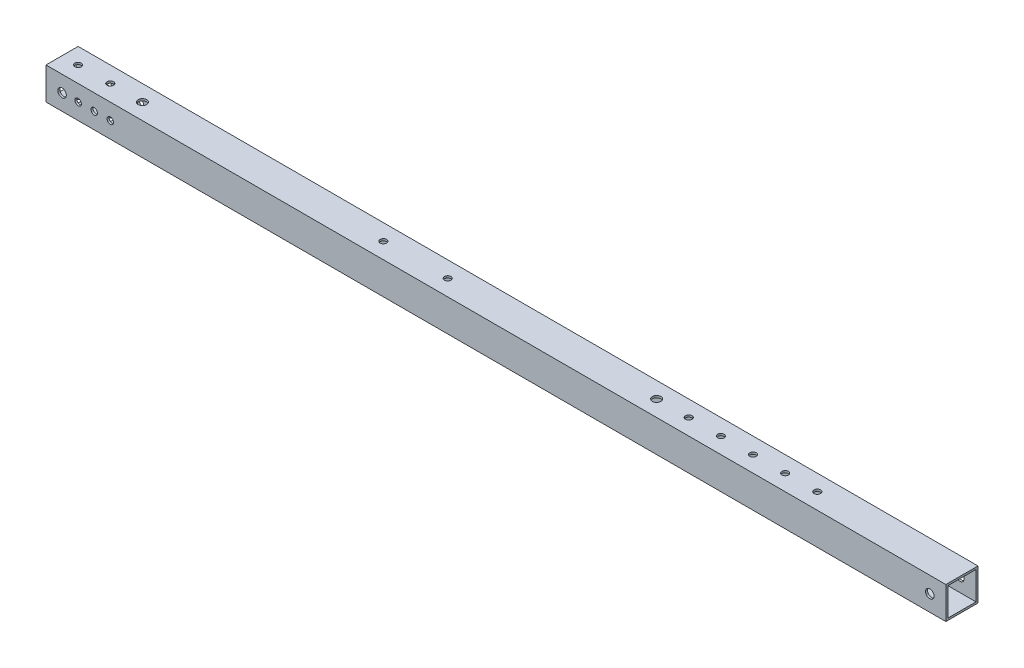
ISO-10303-21;
HEADER;
FILE_DESCRIPTION(('STEP AP214'),'2;1');
FILE_NAME('part.step','',(''),(''),'','','');
FILE_SCHEMA(('AUTOMOTIVE_DESIGN { 1 0 10303 214 1 1 1 1 }'));
ENDSEC;
DATA;
#1=APPLICATION_CONTEXT('core data for automotive mechanical design processes');
#2=APPLICATION_PROTOCOL_DEFINITION('international standard','automotive_design',2000,#1);
#3=PRODUCT_CONTEXT('',#1,'mechanical');
#4=PRODUCT('Part','Part','',(#3));
#5=PRODUCT_RELATED_PRODUCT_CATEGORY('part','',(#4));
#6=PRODUCT_DEFINITION_FORMATION('','',#4);
#7=PRODUCT_DEFINITION_CONTEXT('part definition',#1,'design');
#8=PRODUCT_DEFINITION('design','',#6,#7);
#9=PRODUCT_DEFINITION_SHAPE('','',#8);
#10=(LENGTH_UNIT() NAMED_UNIT(*) SI_UNIT(.MILLI.,.METRE.));
#11=(NAMED_UNIT(*) PLANE_ANGLE_UNIT() SI_UNIT($,.RADIAN.));
#12=(NAMED_UNIT(*) SI_UNIT($,.STERADIAN.) SOLID_ANGLE_UNIT());
#13=UNCERTAINTY_MEASURE_WITH_UNIT(LENGTH_MEASURE(1.E-05),#10,'distance_accuracy_value','');
#14=(GEOMETRIC_REPRESENTATION_CONTEXT(3) GLOBAL_UNCERTAINTY_ASSIGNED_CONTEXT((#13)) GLOBAL_UNIT_ASSIGNED_CONTEXT((#10,
#11,#12)) REPRESENTATION_CONTEXT('',''));
#15=CARTESIAN_POINT('',(0.,0.,0.));
#16=DIRECTION('',(0.,0.,1.));
#17=DIRECTION('',(1.,0.,0.));
#18=AXIS2_PLACEMENT_3D('',#15,#16,#17);
#19=CARTESIAN_POINT('',(711.2,-12.7,12.7));
#20=DIRECTION('',(0.,0.,-1.));
#21=DIRECTION('',(-1.,0.,0.));
#22=AXIS2_PLACEMENT_3D('',#19,#20,#21);
#23=PLANE('',#22);
#24=DIRECTION('',(0.,-1.,0.));
#25=VECTOR('',#24,1.);
#26=CARTESIAN_POINT('',(0.,-12.7,12.7));
#27=LINE('',#26,#25);
#28=CARTESIAN_POINT('',(0.,12.7,12.7));
#29=VERTEX_POINT('',#28);
#30=CARTESIAN_POINT('',(0.,-12.7,12.7));
#31=VERTEX_POINT('',#30);
#32=EDGE_CURVE('E178',#29,#31,#27,.T.);
#33=ORIENTED_EDGE('',*,*,#32,.T.);
#34=DIRECTION('',(-1.,0.,0.));
#35=VECTOR('',#34,1.);
#36=CARTESIAN_POINT('',(711.2,-12.7,12.7));
#37=LINE('',#36,#35);
#38=CARTESIAN_POINT('',(711.2,-12.7,12.7));
#39=VERTEX_POINT('',#38);
#40=EDGE_CURVE('E186',#39,#31,#37,.T.);
#41=ORIENTED_EDGE('',*,*,#40,.F.);
#42=DIRECTION('',(0.,-1.,0.));
#43=VECTOR('',#42,1.);
#44=CARTESIAN_POINT('',(711.2,-12.7,12.7));
#45=LINE('',#44,#43);
#46=CARTESIAN_POINT('',(711.2,12.7,12.7));
#47=VERTEX_POINT('',#46);
#48=EDGE_CURVE('E165',#47,#39,#45,.T.);
#49=ORIENTED_EDGE('',*,*,#48,.F.);
#50=DIRECTION('',(-1.,0.,0.));
#51=VECTOR('',#50,1.);
#52=CARTESIAN_POINT('',(711.2,12.7,12.7));
#53=LINE('',#52,#51);
#54=EDGE_CURVE('E47',#47,#29,#53,.T.);
#55=ORIENTED_EDGE('',*,*,#54,.T.);
#56=EDGE_LOOP('',(#33,#41,#49,#55));
#57=FACE_BOUND('',#56,.T.);
#58=CARTESIAN_POINT('',(50.8,0.,12.7));
#59=DIRECTION('',(0.,0.,1.));
#60=DIRECTION('',(1.,0.,0.));
#61=AXIS2_PLACEMENT_3D('',#58,#59,#60);
#62=CIRCLE('',#61,2.55269999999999);
#63=CARTESIAN_POINT('',(53.3527,0.,12.7));
#64=VERTEX_POINT('',#63);
#65=EDGE_CURVE('E429',#64,#64,#62,.T.);
#66=ORIENTED_EDGE('',*,*,#65,.F.);
#67=EDGE_LOOP('',(#66));
#68=FACE_BOUND('',#67,.T.);
#69=CARTESIAN_POINT('',(38.1,0.,12.7));
#70=DIRECTION('',(0.,0.,1.));
#71=DIRECTION('',(1.,0.,0.));
#72=AXIS2_PLACEMENT_3D('',#69,#70,#71);
#73=CIRCLE('',#72,2.55269999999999);
#74=CARTESIAN_POINT('',(40.6527,0.,12.7));
#75=VERTEX_POINT('',#74);
#76=EDGE_CURVE('E419',#75,#75,#73,.T.);
#77=ORIENTED_EDGE('',*,*,#76,.F.);
#78=EDGE_LOOP('',(#77));
#79=FACE_BOUND('',#78,.T.);
#80=CARTESIAN_POINT('',(25.4,0.,12.7));
#81=DIRECTION('',(0.,0.,1.));
#82=DIRECTION('',(1.,0.,0.));
#83=AXIS2_PLACEMENT_3D('',#80,#81,#82);
#84=CIRCLE('',#83,2.55269999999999);
#85=CARTESIAN_POINT('',(27.9527,0.,12.7));
#86=VERTEX_POINT('',#85);
#87=EDGE_CURVE('E409',#86,#86,#84,.T.);
#88=ORIENTED_EDGE('',*,*,#87,.F.);
#89=EDGE_LOOP('',(#88));
#90=FACE_BOUND('',#89,.T.);
#91=CARTESIAN_POINT('',(698.5,0.,12.7));
#92=DIRECTION('',(0.,0.,1.));
#93=DIRECTION('',(1.,0.,0.));
#94=AXIS2_PLACEMENT_3D('',#91,#92,#93);
#95=CIRCLE('',#94,3.373501);
#96=CARTESIAN_POINT('',(701.873501,0.,12.7));
#97=VERTEX_POINT('',#96);
#98=EDGE_CURVE('E283',#97,#97,#95,.T.);
#99=ORIENTED_EDGE('',*,*,#98,.F.);
#100=EDGE_LOOP('',(#99));
#101=FACE_BOUND('',#100,.T.);
#102=CARTESIAN_POINT('',(12.7,0.,12.7));
#103=DIRECTION('',(0.,0.,1.));
#104=DIRECTION('',(1.,0.,0.));
#105=AXIS2_PLACEMENT_3D('',#102,#103,#104);
#106=CIRCLE('',#105,3.37350099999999);
#107=CARTESIAN_POINT('',(16.073501,0.,12.7));
#108=VERTEX_POINT('',#107);
#109=EDGE_CURVE('E613',#108,#108,#106,.T.);
#110=ORIENTED_EDGE('',*,*,#109,.F.);
#111=EDGE_LOOP('',(#110));
#112=FACE_BOUND('',#111,.T.);
#113=ADVANCED_FACE('F37',(#57,#68,#79,#90,#101,#112),#23,.F.);
#114=CARTESIAN_POINT('',(711.2,0.,0.));
#115=DIRECTION('',(-1.,0.,0.));
#116=DIRECTION('',(0.,0.,1.));
#117=AXIS2_PLACEMENT_3D('',#114,#115,#116);
#118=PLANE('',#117);
#119=DIRECTION('',(0.,1.,0.));
#120=VECTOR('',#119,1.);
#121=CARTESIAN_POINT('',(711.2,-12.7,-12.7));
#122=LINE('',#121,#120);
#123=CARTESIAN_POINT('',(711.2,-12.7,-12.7));
#124=VERTEX_POINT('',#123);
#125=CARTESIAN_POINT('',(711.2,12.7,-12.7));
#126=VERTEX_POINT('',#125);
#127=EDGE_CURVE('E157',#124,#126,#122,.T.);
#128=ORIENTED_EDGE('',*,*,#127,.T.);
#129=DIRECTION('',(0.,0.,1.));
#130=VECTOR('',#129,1.);
#131=CARTESIAN_POINT('',(711.2,12.7,12.7));
#132=LINE('',#131,#130);
#133=EDGE_CURVE('E161',#126,#47,#132,.T.);
#134=ORIENTED_EDGE('',*,*,#133,.T.);
#135=ORIENTED_EDGE('',*,*,#48,.T.);
#136=DIRECTION('',(0.,0.,-1.));
#137=VECTOR('',#136,1.);
#138=CARTESIAN_POINT('',(711.2,-12.7,12.7));
#139=LINE('',#138,#137);
#140=EDGE_CURVE('E168',#39,#124,#139,.T.);
#141=ORIENTED_EDGE('',*,*,#140,.T.);
#142=EDGE_LOOP('',(#128,#134,#135,#141));
#143=FACE_BOUND('',#142,.T.);
#144=DIRECTION('',(0.,1.,0.));
#145=VECTOR('',#144,1.);
#146=CARTESIAN_POINT('',(711.2,-11.1125,-11.1125));
#147=LINE('',#146,#145);
#148=CARTESIAN_POINT('',(711.2,-11.1125,-11.1125));
#149=VERTEX_POINT('',#148);
#150=CARTESIAN_POINT('',(711.2,11.1125,-11.1125));
#151=VERTEX_POINT('',#150);
#152=EDGE_CURVE('E105',#149,#151,#147,.T.);
#153=ORIENTED_EDGE('',*,*,#152,.F.);
#154=DIRECTION('',(0.,0.,-1.));
#155=VECTOR('',#154,1.);
#156=CARTESIAN_POINT('',(711.2,-11.1125,11.1125));
#157=LINE('',#156,#155);
#158=CARTESIAN_POINT('',(711.2,-11.1125,11.1125));
#159=VERTEX_POINT('',#158);
#160=EDGE_CURVE('E133',#159,#149,#157,.T.);
#161=ORIENTED_EDGE('',*,*,#160,.F.);
#162=DIRECTION('',(0.,-1.,0.));
#163=VECTOR('',#162,1.);
#164=CARTESIAN_POINT('',(711.2,-11.1125,11.1125));
#165=LINE('',#164,#163);
#166=CARTESIAN_POINT('',(711.2,11.1125,11.1125));
#167=VERTEX_POINT('',#166);
#168=EDGE_CURVE('E128',#167,#159,#165,.T.);
#169=ORIENTED_EDGE('',*,*,#168,.F.);
#170=DIRECTION('',(0.,0.,1.));
#171=VECTOR('',#170,1.);
#172=CARTESIAN_POINT('',(711.2,11.1125,11.1125));
#173=LINE('',#172,#171);
#174=EDGE_CURVE('E114',#151,#167,#173,.T.);
#175=ORIENTED_EDGE('',*,*,#174,.F.);
#176=EDGE_LOOP('',(#153,#161,#169,#175));
#177=FACE_BOUND('',#176,.T.);
#178=ADVANCED_FACE('F127',(#143,#177),#118,.F.);
#179=CARTESIAN_POINT('',(0.,0.,0.));
#180=DIRECTION('',(-1.,0.,0.));
#181=DIRECTION('',(0.,0.,1.));
#182=AXIS2_PLACEMENT_3D('',#179,#180,#181);
#183=PLANE('',#182);
#184=DIRECTION('',(0.,1.,0.));
#185=VECTOR('',#184,1.);
#186=CARTESIAN_POINT('',(0.,-12.7,-12.7));
#187=LINE('',#186,#185);
#188=CARTESIAN_POINT('',(0.,-12.7,-12.7));
#189=VERTEX_POINT('',#188);
#190=CARTESIAN_POINT('',(0.,12.7,-12.7));
#191=VERTEX_POINT('',#190);
#192=EDGE_CURVE('E123',#189,#191,#187,.T.);
#193=ORIENTED_EDGE('',*,*,#192,.F.);
#194=DIRECTION('',(0.,0.,-1.));
#195=VECTOR('',#194,1.);
#196=CARTESIAN_POINT('',(0.,-12.7,12.7));
#197=LINE('',#196,#195);
#198=EDGE_CURVE('E162',#31,#189,#197,.T.);
#199=ORIENTED_EDGE('',*,*,#198,.F.);
#200=ORIENTED_EDGE('',*,*,#32,.F.);
#201=DIRECTION('',(0.,0.,1.));
#202=VECTOR('',#201,1.);
#203=CARTESIAN_POINT('',(0.,12.7,12.7));
#204=LINE('',#203,#202);
#205=EDGE_CURVE('E175',#191,#29,#204,.T.);
#206=ORIENTED_EDGE('',*,*,#205,.F.);
#207=EDGE_LOOP('',(#193,#199,#200,#206));
#208=FACE_BOUND('',#207,.T.);
#209=DIRECTION('',(0.,0.,-1.));
#210=VECTOR('',#209,1.);
#211=CARTESIAN_POINT('',(0.,-11.1125,11.1125));
#212=LINE('',#211,#210);
#213=CARTESIAN_POINT('',(0.,-11.1125,11.1125));
#214=VERTEX_POINT('',#213);
#215=CARTESIAN_POINT('',(0.,-11.1125,-11.1125));
#216=VERTEX_POINT('',#215);
#217=EDGE_CURVE('E115',#214,#216,#212,.T.);
#218=ORIENTED_EDGE('',*,*,#217,.T.);
#219=DIRECTION('',(0.,1.,0.));
#220=VECTOR('',#219,1.);
#221=CARTESIAN_POINT('',(0.,-11.1125,-11.1125));
#222=LINE('',#221,#220);
#223=CARTESIAN_POINT('',(0.,11.1125,-11.1125));
#224=VERTEX_POINT('',#223);
#225=EDGE_CURVE('E63',#216,#224,#222,.T.);
#226=ORIENTED_EDGE('',*,*,#225,.T.);
#227=DIRECTION('',(0.,0.,1.));
#228=VECTOR('',#227,1.);
#229=CARTESIAN_POINT('',(0.,11.1125,11.1125));
#230=LINE('',#229,#228);
#231=CARTESIAN_POINT('',(0.,11.1125,11.1125));
#232=VERTEX_POINT('',#231);
#233=EDGE_CURVE('E121',#224,#232,#230,.T.);
#234=ORIENTED_EDGE('',*,*,#233,.T.);
#235=DIRECTION('',(0.,-1.,0.));
#236=VECTOR('',#235,1.);
#237=CARTESIAN_POINT('',(0.,-11.1125,11.1125));
#238=LINE('',#237,#236);
#239=EDGE_CURVE('E144',#232,#214,#238,.T.);
#240=ORIENTED_EDGE('',*,*,#239,.T.);
#241=EDGE_LOOP('',(#218,#226,#234,#240));
#242=FACE_BOUND('',#241,.T.);
#243=ADVANCED_FACE('F466',(#208,#242),#183,.T.);
#244=CARTESIAN_POINT('',(711.2,-12.7,-12.7));
#245=DIRECTION('',(0.,0.,1.));
#246=DIRECTION('',(1.,0.,0.));
#247=AXIS2_PLACEMENT_3D('',#244,#245,#246);
#248=PLANE('',#247);
#249=CARTESIAN_POINT('',(12.7,0.,-12.7));
#250=DIRECTION('',(0.,0.,1.));
#251=DIRECTION('',(1.,0.,0.));
#252=AXIS2_PLACEMENT_3D('',#249,#250,#251);
#253=CIRCLE('',#252,3.373501);
#254=CARTESIAN_POINT('',(16.073501,0.,-12.7));
#255=VERTEX_POINT('',#254);
#256=EDGE_CURVE('E611',#255,#255,#253,.T.);
#257=ORIENTED_EDGE('',*,*,#256,.T.);
#258=EDGE_LOOP('',(#257));
#259=FACE_BOUND('',#258,.T.);
#260=CARTESIAN_POINT('',(698.5,0.,-12.7));
#261=DIRECTION('',(0.,0.,1.));
#262=DIRECTION('',(1.,0.,0.));
#263=AXIS2_PLACEMENT_3D('',#260,#261,#262);
#264=CIRCLE('',#263,3.373501);
#265=CARTESIAN_POINT('',(701.873501,0.,-12.7));
#266=VERTEX_POINT('',#265);
#267=EDGE_CURVE('E273',#266,#266,#264,.T.);
#268=ORIENTED_EDGE('',*,*,#267,.T.);
#269=EDGE_LOOP('',(#268));
#270=FACE_BOUND('',#269,.T.);
#271=CARTESIAN_POINT('',(25.4,0.,-12.7));
#272=DIRECTION('',(0.,0.,1.));
#273=DIRECTION('',(1.,0.,0.));
#274=AXIS2_PLACEMENT_3D('',#271,#272,#273);
#275=CIRCLE('',#274,2.55269999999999);
#276=CARTESIAN_POINT('',(27.9527,0.,-12.7));
#277=VERTEX_POINT('',#276);
#278=EDGE_CURVE('E209',#277,#277,#275,.T.);
#279=ORIENTED_EDGE('',*,*,#278,.T.);
#280=EDGE_LOOP('',(#279));
#281=FACE_BOUND('',#280,.T.);
#282=CARTESIAN_POINT('',(38.1,0.,-12.7));
#283=DIRECTION('',(0.,0.,1.));
#284=DIRECTION('',(1.,0.,0.));
#285=AXIS2_PLACEMENT_3D('',#282,#283,#284);
#286=CIRCLE('',#285,2.55269999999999);
#287=CARTESIAN_POINT('',(40.6527,0.,-12.7));
#288=VERTEX_POINT('',#287);
#289=EDGE_CURVE('E203',#288,#288,#286,.T.);
#290=ORIENTED_EDGE('',*,*,#289,.T.);
#291=EDGE_LOOP('',(#290));
#292=FACE_BOUND('',#291,.T.);
#293=CARTESIAN_POINT('',(50.8,0.,-12.7));
#294=DIRECTION('',(0.,0.,1.));
#295=DIRECTION('',(1.,0.,0.));
#296=AXIS2_PLACEMENT_3D('',#293,#294,#295);
#297=CIRCLE('',#296,2.55269999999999);
#298=CARTESIAN_POINT('',(53.3527,0.,-12.7));
#299=VERTEX_POINT('',#298);
#300=EDGE_CURVE('E197',#299,#299,#297,.T.);
#301=ORIENTED_EDGE('',*,*,#300,.T.);
#302=EDGE_LOOP('',(#301));
#303=FACE_BOUND('',#302,.T.);
#304=ORIENTED_EDGE('',*,*,#192,.T.);
#305=DIRECTION('',(-1.,0.,0.));
#306=VECTOR('',#305,1.);
#307=CARTESIAN_POINT('',(711.2,12.7,-12.7));
#308=LINE('',#307,#306);
#309=EDGE_CURVE('E11',#126,#191,#308,.T.);
#310=ORIENTED_EDGE('',*,*,#309,.F.);
#311=ORIENTED_EDGE('',*,*,#127,.F.);
#312=DIRECTION('',(-1.,0.,0.));
#313=VECTOR('',#312,1.);
#314=CARTESIAN_POINT('',(711.2,-12.7,-12.7));
#315=LINE('',#314,#313);
#316=EDGE_CURVE('E171',#124,#189,#315,.T.);
#317=ORIENTED_EDGE('',*,*,#316,.T.);
#318=EDGE_LOOP('',(#304,#310,#311,#317));
#319=FACE_BOUND('',#318,.T.);
#320=ADVANCED_FACE('F39',(#259,#270,#281,#292,#303,#319),#248,.F.);
#321=CARTESIAN_POINT('',(711.2,12.7,12.7));
#322=DIRECTION('',(0.,-1.,0.));
#323=DIRECTION('',(0.,0.,-1.));
#324=AXIS2_PLACEMENT_3D('',#321,#322,#323);
#325=PLANE('',#324);
#326=CARTESIAN_POINT('',(469.9,12.7,0.));
#327=DIRECTION('',(0.,1.,0.));
#328=DIRECTION('',(0.,0.,1.));
#329=AXIS2_PLACEMENT_3D('',#326,#327,#328);
#330=CIRCLE('',#329,3.373501);
#331=CARTESIAN_POINT('',(469.9,12.7,3.373501));
#332=VERTEX_POINT('',#331);
#333=EDGE_CURVE('E279',#332,#332,#330,.T.);
#334=ORIENTED_EDGE('',*,*,#333,.F.);
#335=EDGE_LOOP('',(#334));
#336=FACE_BOUND('',#335,.T.);
#337=CARTESIAN_POINT('',(63.5,12.7,0.));
#338=DIRECTION('',(0.,1.,0.));
#339=DIRECTION('',(0.,0.,1.));
#340=AXIS2_PLACEMENT_3D('',#337,#338,#339);
#341=CIRCLE('',#340,3.373501);
#342=CARTESIAN_POINT('',(63.5,12.7,3.373501));
#343=VERTEX_POINT('',#342);
#344=EDGE_CURVE('E303',#343,#343,#341,.T.);
#345=ORIENTED_EDGE('',*,*,#344,.F.);
#346=EDGE_LOOP('',(#345));
#347=FACE_BOUND('',#346,.T.);
#348=CARTESIAN_POINT('',(12.7,12.7,0.));
#349=DIRECTION('',(0.,1.,0.));
#350=DIRECTION('',(0.,0.,1.));
#351=AXIS2_PLACEMENT_3D('',#348,#349,#350);
#352=CIRCLE('',#351,2.55269999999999);
#353=CARTESIAN_POINT('',(12.7,12.7,2.55269999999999));
#354=VERTEX_POINT('',#353);
#355=EDGE_CURVE('E313',#354,#354,#352,.T.);
#356=ORIENTED_EDGE('',*,*,#355,.F.);
#357=EDGE_LOOP('',(#356));
#358=FACE_BOUND('',#357,.T.);
#359=CARTESIAN_POINT('',(38.1,12.7,0.));
#360=DIRECTION('',(0.,1.,0.));
#361=DIRECTION('',(0.,0.,1.));
#362=AXIS2_PLACEMENT_3D('',#359,#360,#361);
#363=CIRCLE('',#362,2.55269999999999);
#364=CARTESIAN_POINT('',(38.1,12.7,2.55269999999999));
#365=VERTEX_POINT('',#364);
#366=EDGE_CURVE('E323',#365,#365,#363,.T.);
#367=ORIENTED_EDGE('',*,*,#366,.F.);
#368=EDGE_LOOP('',(#367));
#369=FACE_BOUND('',#368,.T.);
#370=CARTESIAN_POINT('',(596.9,12.7,0.));
#371=DIRECTION('',(0.,1.,0.));
#372=DIRECTION('',(0.,0.,1.));
#373=AXIS2_PLACEMENT_3D('',#370,#371,#372);
#374=CIRCLE('',#373,2.55269999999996);
#375=CARTESIAN_POINT('',(596.9,12.7,2.55269999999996));
#376=VERTEX_POINT('',#375);
#377=EDGE_CURVE('E333',#376,#376,#374,.T.);
#378=ORIENTED_EDGE('',*,*,#377,.F.);
#379=EDGE_LOOP('',(#378));
#380=FACE_BOUND('',#379,.T.);
#381=CARTESIAN_POINT('',(254.,12.7,0.));
#382=DIRECTION('',(0.,1.,0.));
#383=DIRECTION('',(0.,0.,1.));
#384=AXIS2_PLACEMENT_3D('',#381,#382,#383);
#385=CIRCLE('',#384,2.55269999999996);
#386=CARTESIAN_POINT('',(254.,12.7,2.55269999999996));
#387=VERTEX_POINT('',#386);
#388=EDGE_CURVE('E343',#387,#387,#385,.T.);
#389=ORIENTED_EDGE('',*,*,#388,.F.);
#390=EDGE_LOOP('',(#389));
#391=FACE_BOUND('',#390,.T.);
#392=CARTESIAN_POINT('',(571.5,12.7,1.77367252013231E-13));
#393=DIRECTION('',(0.,1.,0.));
#394=DIRECTION('',(0.,0.,1.));
#395=AXIS2_PLACEMENT_3D('',#392,#393,#394);
#396=CIRCLE('',#395,2.55269999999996);
#397=CARTESIAN_POINT('',(571.5,12.7,2.55270000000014));
#398=VERTEX_POINT('',#397);
#399=EDGE_CURVE('E353',#398,#398,#396,.T.);
#400=ORIENTED_EDGE('',*,*,#399,.F.);
#401=EDGE_LOOP('',(#400));
#402=FACE_BOUND('',#401,.T.);
#403=CARTESIAN_POINT('',(546.1,12.7,3.54734504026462E-13));
#404=DIRECTION('',(0.,1.,0.));
#405=DIRECTION('',(0.,0.,1.));
#406=AXIS2_PLACEMENT_3D('',#403,#404,#405);
#407=CIRCLE('',#406,2.55269999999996);
#408=CARTESIAN_POINT('',(546.1,12.7,2.55270000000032));
#409=VERTEX_POINT('',#408);
#410=EDGE_CURVE('E363',#409,#409,#407,.T.);
#411=ORIENTED_EDGE('',*,*,#410,.F.);
#412=EDGE_LOOP('',(#411));
#413=FACE_BOUND('',#412,.T.);
#414=CARTESIAN_POINT('',(520.7,12.7,5.32101756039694E-13));
#415=DIRECTION('',(0.,1.,0.));
#416=DIRECTION('',(0.,0.,1.));
#417=AXIS2_PLACEMENT_3D('',#414,#415,#416);
#418=CIRCLE('',#417,2.55269999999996);
#419=CARTESIAN_POINT('',(520.7,12.7,2.5527000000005));
#420=VERTEX_POINT('',#419);
#421=EDGE_CURVE('E379',#420,#420,#418,.T.);
#422=ORIENTED_EDGE('',*,*,#421,.F.);
#423=EDGE_LOOP('',(#422));
#424=FACE_BOUND('',#423,.T.);
#425=CARTESIAN_POINT('',(495.3,12.7,7.09469008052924E-13));
#426=DIRECTION('',(0.,1.,0.));
#427=DIRECTION('',(0.,0.,1.));
#428=AXIS2_PLACEMENT_3D('',#425,#426,#427);
#429=CIRCLE('',#428,2.55269999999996);
#430=CARTESIAN_POINT('',(495.3,12.7,2.55270000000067));
#431=VERTEX_POINT('',#430);
#432=EDGE_CURVE('E389',#431,#431,#429,.T.);
#433=ORIENTED_EDGE('',*,*,#432,.F.);
#434=EDGE_LOOP('',(#433));
#435=FACE_BOUND('',#434,.T.);
#436=CARTESIAN_POINT('',(304.8,12.7,0.));
#437=DIRECTION('',(0.,1.,0.));
#438=DIRECTION('',(0.,0.,1.));
#439=AXIS2_PLACEMENT_3D('',#436,#437,#438);
#440=CIRCLE('',#439,2.55269999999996);
#441=CARTESIAN_POINT('',(304.8,12.7,2.55269999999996));
#442=VERTEX_POINT('',#441);
#443=EDGE_CURVE('E399',#442,#442,#440,.T.);
#444=ORIENTED_EDGE('',*,*,#443,.F.);
#445=EDGE_LOOP('',(#444));
#446=FACE_BOUND('',#445,.T.);
#447=ORIENTED_EDGE('',*,*,#205,.T.);
#448=ORIENTED_EDGE('',*,*,#54,.F.);
#449=ORIENTED_EDGE('',*,*,#133,.F.);
#450=ORIENTED_EDGE('',*,*,#309,.T.);
#451=EDGE_LOOP('',(#447,#448,#449,#450));
#452=FACE_BOUND('',#451,.T.);
#453=ADVANCED_FACE('F454',(#336,#347,#358,#369,#380,#391,#402,#413,#424,#435,#446,#452),#325,.F.);
#454=CARTESIAN_POINT('',(711.2,-12.7,12.7));
#455=DIRECTION('',(0.,1.,0.));
#456=DIRECTION('',(0.,0.,1.));
#457=AXIS2_PLACEMENT_3D('',#454,#455,#456);
#458=PLANE('',#457);
#459=CARTESIAN_POINT('',(469.9,-12.7,0.));
#460=DIRECTION('',(0.,1.,0.));
#461=DIRECTION('',(0.,0.,1.));
#462=AXIS2_PLACEMENT_3D('',#459,#460,#461);
#463=CIRCLE('',#462,3.373501);
#464=CARTESIAN_POINT('',(469.9,-12.7,3.373501));
#465=VERTEX_POINT('',#464);
#466=EDGE_CURVE('E268',#465,#465,#463,.T.);
#467=ORIENTED_EDGE('',*,*,#466,.T.);
#468=EDGE_LOOP('',(#467));
#469=FACE_BOUND('',#468,.T.);
#470=CARTESIAN_POINT('',(63.5,-12.7,0.));
#471=DIRECTION('',(0.,1.,0.));
#472=DIRECTION('',(0.,0.,1.));
#473=AXIS2_PLACEMENT_3D('',#470,#471,#472);
#474=CIRCLE('',#473,3.37350099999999);
#475=CARTESIAN_POINT('',(63.5,-12.7,3.37350099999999));
#476=VERTEX_POINT('',#475);
#477=EDGE_CURVE('E263',#476,#476,#474,.T.);
#478=ORIENTED_EDGE('',*,*,#477,.T.);
#479=EDGE_LOOP('',(#478));
#480=FACE_BOUND('',#479,.T.);
#481=CARTESIAN_POINT('',(12.7,-12.7,0.));
#482=DIRECTION('',(0.,1.,0.));
#483=DIRECTION('',(0.,0.,1.));
#484=AXIS2_PLACEMENT_3D('',#481,#482,#483);
#485=CIRCLE('',#484,2.55269999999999);
#486=CARTESIAN_POINT('',(12.7,-12.7,2.55269999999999));
#487=VERTEX_POINT('',#486);
#488=EDGE_CURVE('E257',#487,#487,#485,.T.);
#489=ORIENTED_EDGE('',*,*,#488,.T.);
#490=EDGE_LOOP('',(#489));
#491=FACE_BOUND('',#490,.T.);
#492=CARTESIAN_POINT('',(38.1,-12.7,0.));
#493=DIRECTION('',(0.,1.,0.));
#494=DIRECTION('',(0.,0.,1.));
#495=AXIS2_PLACEMENT_3D('',#492,#493,#494);
#496=CIRCLE('',#495,2.55269999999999);
#497=CARTESIAN_POINT('',(38.1,-12.7,2.55269999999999));
#498=VERTEX_POINT('',#497);
#499=EDGE_CURVE('E251',#498,#498,#496,.T.);
#500=ORIENTED_EDGE('',*,*,#499,.T.);
#501=EDGE_LOOP('',(#500));
#502=FACE_BOUND('',#501,.T.);
#503=CARTESIAN_POINT('',(596.9,-12.7,0.));
#504=DIRECTION('',(0.,1.,0.));
#505=DIRECTION('',(0.,0.,1.));
#506=AXIS2_PLACEMENT_3D('',#503,#504,#505);
#507=CIRCLE('',#506,2.55269999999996);
#508=CARTESIAN_POINT('',(596.9,-12.7,2.55269999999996));
#509=VERTEX_POINT('',#508);
#510=EDGE_CURVE('E245',#509,#509,#507,.T.);
#511=ORIENTED_EDGE('',*,*,#510,.T.);
#512=EDGE_LOOP('',(#511));
#513=FACE_BOUND('',#512,.T.);
#514=CARTESIAN_POINT('',(254.,-12.7,0.));
#515=DIRECTION('',(0.,1.,0.));
#516=DIRECTION('',(0.,0.,1.));
#517=AXIS2_PLACEMENT_3D('',#514,#515,#516);
#518=CIRCLE('',#517,2.55270000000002);
#519=CARTESIAN_POINT('',(254.,-12.7,2.55270000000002));
#520=VERTEX_POINT('',#519);
#521=EDGE_CURVE('E239',#520,#520,#518,.T.);
#522=ORIENTED_EDGE('',*,*,#521,.T.);
#523=EDGE_LOOP('',(#522));
#524=FACE_BOUND('',#523,.T.);
#525=CARTESIAN_POINT('',(571.5,-12.7,1.77367252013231E-13));
#526=DIRECTION('',(0.,1.,0.));
#527=DIRECTION('',(0.,0.,1.));
#528=AXIS2_PLACEMENT_3D('',#525,#526,#527);
#529=CIRCLE('',#528,2.55269999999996);
#530=CARTESIAN_POINT('',(571.5,-12.7,2.55270000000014));
#531=VERTEX_POINT('',#530);
#532=EDGE_CURVE('E233',#531,#531,#529,.T.);
#533=ORIENTED_EDGE('',*,*,#532,.T.);
#534=EDGE_LOOP('',(#533));
#535=FACE_BOUND('',#534,.T.);
#536=CARTESIAN_POINT('',(546.1,-12.7,3.54734504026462E-13));
#537=DIRECTION('',(0.,1.,0.));
#538=DIRECTION('',(0.,0.,1.));
#539=AXIS2_PLACEMENT_3D('',#536,#537,#538);
#540=CIRCLE('',#539,2.55269999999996);
#541=CARTESIAN_POINT('',(546.1,-12.7,2.55270000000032));
#542=VERTEX_POINT('',#541);
#543=EDGE_CURVE('E367',#542,#542,#540,.T.);
#544=ORIENTED_EDGE('',*,*,#543,.T.);
#545=EDGE_LOOP('',(#544));
#546=FACE_BOUND('',#545,.T.);
#547=CARTESIAN_POINT('',(520.7,-12.7,5.32101756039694E-13));
#548=DIRECTION('',(0.,1.,0.));
#549=DIRECTION('',(0.,0.,1.));
#550=AXIS2_PLACEMENT_3D('',#547,#548,#549);
#551=CIRCLE('',#550,2.55269999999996);
#552=CARTESIAN_POINT('',(520.7,-12.7,2.5527000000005));
#553=VERTEX_POINT('',#552);
#554=EDGE_CURVE('E227',#553,#553,#551,.T.);
#555=ORIENTED_EDGE('',*,*,#554,.T.);
#556=EDGE_LOOP('',(#555));
#557=FACE_BOUND('',#556,.T.);
#558=CARTESIAN_POINT('',(495.3,-12.7,7.09469008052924E-13));
#559=DIRECTION('',(0.,1.,0.));
#560=DIRECTION('',(0.,0.,1.));
#561=AXIS2_PLACEMENT_3D('',#558,#559,#560);
#562=CIRCLE('',#561,2.55270000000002);
#563=CARTESIAN_POINT('',(495.3,-12.7,2.55270000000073));
#564=VERTEX_POINT('',#563);
#565=EDGE_CURVE('E221',#564,#564,#562,.T.);
#566=ORIENTED_EDGE('',*,*,#565,.T.);
#567=EDGE_LOOP('',(#566));
#568=FACE_BOUND('',#567,.T.);
#569=CARTESIAN_POINT('',(304.8,-12.7,0.));
#570=DIRECTION('',(0.,1.,0.));
#571=DIRECTION('',(0.,0.,1.));
#572=AXIS2_PLACEMENT_3D('',#569,#570,#571);
#573=CIRCLE('',#572,2.55270000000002);
#574=CARTESIAN_POINT('',(304.8,-12.7,2.55270000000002));
#575=VERTEX_POINT('',#574);
#576=EDGE_CURVE('E215',#575,#575,#573,.T.);
#577=ORIENTED_EDGE('',*,*,#576,.T.);
#578=EDGE_LOOP('',(#577));
#579=FACE_BOUND('',#578,.T.);
#580=ORIENTED_EDGE('',*,*,#198,.T.);
#581=ORIENTED_EDGE('',*,*,#316,.F.);
#582=ORIENTED_EDGE('',*,*,#140,.F.);
#583=ORIENTED_EDGE('',*,*,#40,.T.);
#584=EDGE_LOOP('',(#580,#581,#582,#583));
#585=FACE_BOUND('',#584,.T.);
#586=ADVANCED_FACE('F444',(#469,#480,#491,#502,#513,#524,#535,#546,#557,#568,#579,#585),#458,.F.);
#587=CARTESIAN_POINT('',(711.2,-11.1125,-11.1125));
#588=DIRECTION('',(0.,0.,1.));
#589=DIRECTION('',(1.,0.,0.));
#590=AXIS2_PLACEMENT_3D('',#587,#588,#589);
#591=PLANE('',#590);
#592=CARTESIAN_POINT('',(12.7,0.,-11.1125));
#593=DIRECTION('',(0.,0.,1.));
#594=DIRECTION('',(1.,0.,0.));
#595=AXIS2_PLACEMENT_3D('',#592,#593,#594);
#596=CIRCLE('',#595,3.37350099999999);
#597=CARTESIAN_POINT('',(16.073501,0.,-11.1125));
#598=VERTEX_POINT('',#597);
#599=EDGE_CURVE('E41',#598,#598,#596,.T.);
#600=ORIENTED_EDGE('',*,*,#599,.F.);
#601=EDGE_LOOP('',(#600));
#602=FACE_BOUND('',#601,.T.);
#603=CARTESIAN_POINT('',(698.5,0.,-11.1125));
#604=DIRECTION('',(0.,0.,1.));
#605=DIRECTION('',(1.,0.,0.));
#606=AXIS2_PLACEMENT_3D('',#603,#604,#605);
#607=CIRCLE('',#606,3.373501);
#608=CARTESIAN_POINT('',(701.873501,0.,-11.1125));
#609=VERTEX_POINT('',#608);
#610=EDGE_CURVE('E272',#609,#609,#607,.T.);
#611=ORIENTED_EDGE('',*,*,#610,.F.);
#612=EDGE_LOOP('',(#611));
#613=FACE_BOUND('',#612,.T.);
#614=CARTESIAN_POINT('',(25.4,0.,-11.1125));
#615=DIRECTION('',(0.,0.,1.));
#616=DIRECTION('',(1.,0.,0.));
#617=AXIS2_PLACEMENT_3D('',#614,#615,#616);
#618=CIRCLE('',#617,2.55269999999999);
#619=CARTESIAN_POINT('',(27.9527,0.,-11.1125));
#620=VERTEX_POINT('',#619);
#621=EDGE_CURVE('E208',#620,#620,#618,.T.);
#622=ORIENTED_EDGE('',*,*,#621,.F.);
#623=EDGE_LOOP('',(#622));
#624=FACE_BOUND('',#623,.T.);
#625=CARTESIAN_POINT('',(38.1,0.,-11.1125));
#626=DIRECTION('',(0.,0.,1.));
#627=DIRECTION('',(1.,0.,0.));
#628=AXIS2_PLACEMENT_3D('',#625,#626,#627);
#629=CIRCLE('',#628,2.55269999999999);
#630=CARTESIAN_POINT('',(40.6527,0.,-11.1125));
#631=VERTEX_POINT('',#630);
#632=EDGE_CURVE('E202',#631,#631,#629,.T.);
#633=ORIENTED_EDGE('',*,*,#632,.F.);
#634=EDGE_LOOP('',(#633));
#635=FACE_BOUND('',#634,.T.);
#636=CARTESIAN_POINT('',(50.8,0.,-11.1125));
#637=DIRECTION('',(0.,0.,1.));
#638=DIRECTION('',(1.,0.,0.));
#639=AXIS2_PLACEMENT_3D('',#636,#637,#638);
#640=CIRCLE('',#639,2.55269999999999);
#641=CARTESIAN_POINT('',(53.3527,0.,-11.1125));
#642=VERTEX_POINT('',#641);
#643=EDGE_CURVE('E141',#642,#642,#640,.T.);
#644=ORIENTED_EDGE('',*,*,#643,.F.);
#645=EDGE_LOOP('',(#644));
#646=FACE_BOUND('',#645,.T.);
#647=ORIENTED_EDGE('',*,*,#225,.F.);
#648=DIRECTION('',(-1.,0.,0.));
#649=VECTOR('',#648,1.);
#650=CARTESIAN_POINT('',(711.2,-11.1125,-11.1125));
#651=LINE('',#650,#649);
#652=EDGE_CURVE('E109',#149,#216,#651,.T.);
#653=ORIENTED_EDGE('',*,*,#652,.F.);
#654=ORIENTED_EDGE('',*,*,#152,.T.);
#655=DIRECTION('',(-1.,0.,0.));
#656=VECTOR('',#655,1.);
#657=CARTESIAN_POINT('',(711.2,11.1125,-11.1125));
#658=LINE('',#657,#656);
#659=EDGE_CURVE('E108',#151,#224,#658,.T.);
#660=ORIENTED_EDGE('',*,*,#659,.T.);
#661=EDGE_LOOP('',(#647,#653,#654,#660));
#662=FACE_BOUND('',#661,.T.);
#663=ADVANCED_FACE('F107',(#602,#613,#624,#635,#646,#662),#591,.T.);
#664=CARTESIAN_POINT('',(711.2,11.1125,11.1125));
#665=DIRECTION('',(0.,-1.,0.));
#666=DIRECTION('',(0.,0.,-1.));
#667=AXIS2_PLACEMENT_3D('',#664,#665,#666);
#668=PLANE('',#667);
#669=CARTESIAN_POINT('',(469.9,11.1125,0.));
#670=DIRECTION('',(0.,-1.,0.));
#671=DIRECTION('',(0.,0.,-1.));
#672=AXIS2_PLACEMENT_3D('',#669,#670,#671);
#673=CIRCLE('',#672,3.373501);
#674=CARTESIAN_POINT('',(469.9,11.1125,-3.373501));
#675=VERTEX_POINT('',#674);
#676=EDGE_CURVE('E267',#675,#675,#673,.T.);
#677=ORIENTED_EDGE('',*,*,#676,.F.);
#678=EDGE_LOOP('',(#677));
#679=FACE_BOUND('',#678,.T.);
#680=CARTESIAN_POINT('',(63.5,11.1125,0.));
#681=DIRECTION('',(0.,-1.,0.));
#682=DIRECTION('',(0.,0.,-1.));
#683=AXIS2_PLACEMENT_3D('',#680,#681,#682);
#684=CIRCLE('',#683,3.37350099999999);
#685=CARTESIAN_POINT('',(63.5,11.1125,-3.37350099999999));
#686=VERTEX_POINT('',#685);
#687=EDGE_CURVE('E262',#686,#686,#684,.T.);
#688=ORIENTED_EDGE('',*,*,#687,.F.);
#689=EDGE_LOOP('',(#688));
#690=FACE_BOUND('',#689,.T.);
#691=CARTESIAN_POINT('',(12.7,11.1125,0.));
#692=DIRECTION('',(0.,-1.,0.));
#693=DIRECTION('',(0.,0.,-1.));
#694=AXIS2_PLACEMENT_3D('',#691,#692,#693);
#695=CIRCLE('',#694,2.55269999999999);
#696=CARTESIAN_POINT('',(12.7,11.1125,-2.55269999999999));
#697=VERTEX_POINT('',#696);
#698=EDGE_CURVE('E256',#697,#697,#695,.T.);
#699=ORIENTED_EDGE('',*,*,#698,.F.);
#700=EDGE_LOOP('',(#699));
#701=FACE_BOUND('',#700,.T.);
#702=CARTESIAN_POINT('',(38.1,11.1125,0.));
#703=DIRECTION('',(0.,-1.,0.));
#704=DIRECTION('',(0.,0.,-1.));
#705=AXIS2_PLACEMENT_3D('',#702,#703,#704);
#706=CIRCLE('',#705,2.55269999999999);
#707=CARTESIAN_POINT('',(38.1,11.1125,-2.55269999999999));
#708=VERTEX_POINT('',#707);
#709=EDGE_CURVE('E250',#708,#708,#706,.T.);
#710=ORIENTED_EDGE('',*,*,#709,.F.);
#711=EDGE_LOOP('',(#710));
#712=FACE_BOUND('',#711,.T.);
#713=CARTESIAN_POINT('',(596.9,11.1125,0.));
#714=DIRECTION('',(0.,-1.,0.));
#715=DIRECTION('',(0.,0.,-1.));
#716=AXIS2_PLACEMENT_3D('',#713,#714,#715);
#717=CIRCLE('',#716,2.55269999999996);
#718=CARTESIAN_POINT('',(596.9,11.1125,-2.55269999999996));
#719=VERTEX_POINT('',#718);
#720=EDGE_CURVE('E240',#719,#719,#717,.T.);
#721=ORIENTED_EDGE('',*,*,#720,.F.);
#722=EDGE_LOOP('',(#721));
#723=FACE_BOUND('',#722,.T.);
#724=CARTESIAN_POINT('',(254.,11.1125,0.));
#725=DIRECTION('',(0.,-1.,0.));
#726=DIRECTION('',(0.,0.,-1.));
#727=AXIS2_PLACEMENT_3D('',#724,#725,#726);
#728=CIRCLE('',#727,2.55269999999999);
#729=CARTESIAN_POINT('',(254.,11.1125,-2.55269999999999));
#730=VERTEX_POINT('',#729);
#731=EDGE_CURVE('E238',#730,#730,#728,.T.);
#732=ORIENTED_EDGE('',*,*,#731,.F.);
#733=EDGE_LOOP('',(#732));
#734=FACE_BOUND('',#733,.T.);
#735=CARTESIAN_POINT('',(571.5,11.1125,1.77367252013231E-13));
#736=DIRECTION('',(0.,-1.,0.));
#737=DIRECTION('',(0.,0.,-1.));
#738=AXIS2_PLACEMENT_3D('',#735,#736,#737);
#739=CIRCLE('',#738,2.55269999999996);
#740=CARTESIAN_POINT('',(571.5,11.1125,-2.55269999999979));
#741=VERTEX_POINT('',#740);
#742=EDGE_CURVE('E232',#741,#741,#739,.T.);
#743=ORIENTED_EDGE('',*,*,#742,.F.);
#744=EDGE_LOOP('',(#743));
#745=FACE_BOUND('',#744,.T.);
#746=CARTESIAN_POINT('',(546.1,11.1125,3.54734504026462E-13));
#747=DIRECTION('',(0.,-1.,0.));
#748=DIRECTION('',(0.,0.,-1.));
#749=AXIS2_PLACEMENT_3D('',#746,#747,#748);
#750=CIRCLE('',#749,2.55269999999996);
#751=CARTESIAN_POINT('',(546.1,11.1125,-2.55269999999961));
#752=VERTEX_POINT('',#751);
#753=EDGE_CURVE('E371',#752,#752,#750,.T.);
#754=ORIENTED_EDGE('',*,*,#753,.F.);
#755=EDGE_LOOP('',(#754));
#756=FACE_BOUND('',#755,.T.);
#757=CARTESIAN_POINT('',(520.7,11.1125,5.32101756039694E-13));
#758=DIRECTION('',(0.,-1.,0.));
#759=DIRECTION('',(0.,0.,-1.));
#760=AXIS2_PLACEMENT_3D('',#757,#758,#759);
#761=CIRCLE('',#760,2.55269999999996);
#762=CARTESIAN_POINT('',(520.7,11.1125,-2.55269999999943));
#763=VERTEX_POINT('',#762);
#764=EDGE_CURVE('E226',#763,#763,#761,.T.);
#765=ORIENTED_EDGE('',*,*,#764,.F.);
#766=EDGE_LOOP('',(#765));
#767=FACE_BOUND('',#766,.T.);
#768=CARTESIAN_POINT('',(495.3,11.1125,7.09469008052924E-13));
#769=DIRECTION('',(0.,-1.,0.));
#770=DIRECTION('',(0.,0.,-1.));
#771=AXIS2_PLACEMENT_3D('',#768,#769,#770);
#772=CIRCLE('',#771,2.55269999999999);
#773=CARTESIAN_POINT('',(495.3,11.1125,-2.55269999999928));
#774=VERTEX_POINT('',#773);
#775=EDGE_CURVE('E220',#774,#774,#772,.T.);
#776=ORIENTED_EDGE('',*,*,#775,.F.);
#777=EDGE_LOOP('',(#776));
#778=FACE_BOUND('',#777,.T.);
#779=CARTESIAN_POINT('',(304.8,11.1125,0.));
#780=DIRECTION('',(0.,-1.,0.));
#781=DIRECTION('',(0.,0.,-1.));
#782=AXIS2_PLACEMENT_3D('',#779,#780,#781);
#783=CIRCLE('',#782,2.55269999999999);
#784=CARTESIAN_POINT('',(304.8,11.1125,-2.55269999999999));
#785=VERTEX_POINT('',#784);
#786=EDGE_CURVE('E214',#785,#785,#783,.T.);
#787=ORIENTED_EDGE('',*,*,#786,.F.);
#788=EDGE_LOOP('',(#787));
#789=FACE_BOUND('',#788,.T.);
#790=ORIENTED_EDGE('',*,*,#233,.F.);
#791=ORIENTED_EDGE('',*,*,#659,.F.);
#792=ORIENTED_EDGE('',*,*,#174,.T.);
#793=DIRECTION('',(-1.,0.,0.));
#794=VECTOR('',#793,1.);
#795=CARTESIAN_POINT('',(711.2,11.1125,11.1125));
#796=LINE('',#795,#794);
#797=EDGE_CURVE('E124',#167,#232,#796,.T.);
#798=ORIENTED_EDGE('',*,*,#797,.T.);
#799=EDGE_LOOP('',(#790,#791,#792,#798));
#800=FACE_BOUND('',#799,.T.);
#801=ADVANCED_FACE('F118',(#679,#690,#701,#712,#723,#734,#745,#756,#767,#778,#789,#800),#668,.T.);
#802=CARTESIAN_POINT('',(711.2,-11.1125,11.1125));
#803=DIRECTION('',(0.,0.,-1.));
#804=DIRECTION('',(-1.,0.,0.));
#805=AXIS2_PLACEMENT_3D('',#802,#803,#804);
#806=PLANE('',#805);
#807=CARTESIAN_POINT('',(12.7,0.,11.1125));
#808=DIRECTION('',(0.,0.,-1.));
#809=DIRECTION('',(-1.,0.,0.));
#810=AXIS2_PLACEMENT_3D('',#807,#808,#809);
#811=CIRCLE('',#810,3.37350099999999);
#812=CARTESIAN_POINT('',(9.32649900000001,0.,11.1125));
#813=VERTEX_POINT('',#812);
#814=EDGE_CURVE('E290',#813,#813,#811,.T.);
#815=ORIENTED_EDGE('',*,*,#814,.F.);
#816=EDGE_LOOP('',(#815));
#817=FACE_BOUND('',#816,.T.);
#818=CARTESIAN_POINT('',(698.5,0.,11.1125));
#819=DIRECTION('',(0.,0.,-1.));
#820=DIRECTION('',(-1.,0.,0.));
#821=AXIS2_PLACEMENT_3D('',#818,#819,#820);
#822=CIRCLE('',#821,3.373501);
#823=CARTESIAN_POINT('',(695.126499,0.,11.1125));
#824=VERTEX_POINT('',#823);
#825=EDGE_CURVE('E269',#824,#824,#822,.T.);
#826=ORIENTED_EDGE('',*,*,#825,.F.);
#827=EDGE_LOOP('',(#826));
#828=FACE_BOUND('',#827,.T.);
#829=CARTESIAN_POINT('',(25.4,0.,11.1125));
#830=DIRECTION('',(0.,0.,-1.));
#831=DIRECTION('',(-1.,0.,0.));
#832=AXIS2_PLACEMENT_3D('',#829,#830,#831);
#833=CIRCLE('',#832,2.55269999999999);
#834=CARTESIAN_POINT('',(22.8473,0.,11.1125));
#835=VERTEX_POINT('',#834);
#836=EDGE_CURVE('E204',#835,#835,#833,.T.);
#837=ORIENTED_EDGE('',*,*,#836,.F.);
#838=EDGE_LOOP('',(#837));
#839=FACE_BOUND('',#838,.T.);
#840=CARTESIAN_POINT('',(38.1,0.,11.1125));
#841=DIRECTION('',(0.,0.,-1.));
#842=DIRECTION('',(-1.,0.,0.));
#843=AXIS2_PLACEMENT_3D('',#840,#841,#842);
#844=CIRCLE('',#843,2.55269999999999);
#845=CARTESIAN_POINT('',(35.5473,0.,11.1125));
#846=VERTEX_POINT('',#845);
#847=EDGE_CURVE('E198',#846,#846,#844,.T.);
#848=ORIENTED_EDGE('',*,*,#847,.F.);
#849=EDGE_LOOP('',(#848));
#850=FACE_BOUND('',#849,.T.);
#851=CARTESIAN_POINT('',(50.8,0.,11.1125));
#852=DIRECTION('',(0.,0.,-1.));
#853=DIRECTION('',(-1.,0.,0.));
#854=AXIS2_PLACEMENT_3D('',#851,#852,#853);
#855=CIRCLE('',#854,2.55269999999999);
#856=CARTESIAN_POINT('',(48.2473,0.,11.1125));
#857=VERTEX_POINT('',#856);
#858=EDGE_CURVE('E193',#857,#857,#855,.T.);
#859=ORIENTED_EDGE('',*,*,#858,.F.);
#860=EDGE_LOOP('',(#859));
#861=FACE_BOUND('',#860,.T.);
#862=ORIENTED_EDGE('',*,*,#239,.F.);
#863=ORIENTED_EDGE('',*,*,#797,.F.);
#864=ORIENTED_EDGE('',*,*,#168,.T.);
#865=DIRECTION('',(-1.,0.,0.));
#866=VECTOR('',#865,1.);
#867=CARTESIAN_POINT('',(711.2,-11.1125,11.1125));
#868=LINE('',#867,#866);
#869=EDGE_CURVE('E55',#159,#214,#868,.T.);
#870=ORIENTED_EDGE('',*,*,#869,.T.);
#871=EDGE_LOOP('',(#862,#863,#864,#870));
#872=FACE_BOUND('',#871,.T.);
#873=ADVANCED_FACE('F451',(#817,#828,#839,#850,#861,#872),#806,.T.);
#874=CARTESIAN_POINT('',(711.2,-11.1125,11.1125));
#875=DIRECTION('',(0.,1.,0.));
#876=DIRECTION('',(0.,0.,1.));
#877=AXIS2_PLACEMENT_3D('',#874,#875,#876);
#878=PLANE('',#877);
#879=CARTESIAN_POINT('',(469.9,-11.1125,0.));
#880=DIRECTION('',(0.,1.,0.));
#881=DIRECTION('',(0.,0.,1.));
#882=AXIS2_PLACEMENT_3D('',#879,#880,#881);
#883=CIRCLE('',#882,3.373501);
#884=CARTESIAN_POINT('',(469.9,-11.1125,3.373501));
#885=VERTEX_POINT('',#884);
#886=EDGE_CURVE('E264',#885,#885,#883,.T.);
#887=ORIENTED_EDGE('',*,*,#886,.F.);
#888=EDGE_LOOP('',(#887));
#889=FACE_BOUND('',#888,.T.);
#890=CARTESIAN_POINT('',(63.5,-11.1125,0.));
#891=DIRECTION('',(0.,1.,0.));
#892=DIRECTION('',(0.,0.,1.));
#893=AXIS2_PLACEMENT_3D('',#890,#891,#892);
#894=CIRCLE('',#893,3.37350099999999);
#895=CARTESIAN_POINT('',(63.5,-11.1125,3.37350099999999));
#896=VERTEX_POINT('',#895);
#897=EDGE_CURVE('E258',#896,#896,#894,.T.);
#898=ORIENTED_EDGE('',*,*,#897,.F.);
#899=EDGE_LOOP('',(#898));
#900=FACE_BOUND('',#899,.T.);
#901=CARTESIAN_POINT('',(12.7,-11.1125,0.));
#902=DIRECTION('',(0.,1.,0.));
#903=DIRECTION('',(0.,0.,1.));
#904=AXIS2_PLACEMENT_3D('',#901,#902,#903);
#905=CIRCLE('',#904,2.55269999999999);
#906=CARTESIAN_POINT('',(12.7,-11.1125,2.55269999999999));
#907=VERTEX_POINT('',#906);
#908=EDGE_CURVE('E252',#907,#907,#905,.T.);
#909=ORIENTED_EDGE('',*,*,#908,.F.);
#910=EDGE_LOOP('',(#909));
#911=FACE_BOUND('',#910,.T.);
#912=CARTESIAN_POINT('',(38.1,-11.1125,0.));
#913=DIRECTION('',(0.,1.,0.));
#914=DIRECTION('',(0.,0.,1.));
#915=AXIS2_PLACEMENT_3D('',#912,#913,#914);
#916=CIRCLE('',#915,2.55269999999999);
#917=CARTESIAN_POINT('',(38.1,-11.1125,2.55269999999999));
#918=VERTEX_POINT('',#917);
#919=EDGE_CURVE('E246',#918,#918,#916,.T.);
#920=ORIENTED_EDGE('',*,*,#919,.F.);
#921=EDGE_LOOP('',(#920));
#922=FACE_BOUND('',#921,.T.);
#923=CARTESIAN_POINT('',(596.9,-11.1125,0.));
#924=DIRECTION('',(0.,1.,0.));
#925=DIRECTION('',(0.,0.,1.));
#926=AXIS2_PLACEMENT_3D('',#923,#924,#925);
#927=CIRCLE('',#926,2.55269999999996);
#928=CARTESIAN_POINT('',(596.9,-11.1125,2.55269999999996));
#929=VERTEX_POINT('',#928);
#930=EDGE_CURVE('E244',#929,#929,#927,.T.);
#931=ORIENTED_EDGE('',*,*,#930,.F.);
#932=EDGE_LOOP('',(#931));
#933=FACE_BOUND('',#932,.T.);
#934=CARTESIAN_POINT('',(254.,-11.1125,0.));
#935=DIRECTION('',(0.,1.,0.));
#936=DIRECTION('',(0.,0.,1.));
#937=AXIS2_PLACEMENT_3D('',#934,#935,#936);
#938=CIRCLE('',#937,2.55269999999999);
#939=CARTESIAN_POINT('',(254.,-11.1125,2.55269999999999));
#940=VERTEX_POINT('',#939);
#941=EDGE_CURVE('E234',#940,#940,#938,.T.);
#942=ORIENTED_EDGE('',*,*,#941,.F.);
#943=EDGE_LOOP('',(#942));
#944=FACE_BOUND('',#943,.T.);
#945=CARTESIAN_POINT('',(571.5,-11.1125,1.77367252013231E-13));
#946=DIRECTION('',(0.,1.,0.));
#947=DIRECTION('',(0.,0.,1.));
#948=AXIS2_PLACEMENT_3D('',#945,#946,#947);
#949=CIRCLE('',#948,2.55269999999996);
#950=CARTESIAN_POINT('',(571.5,-11.1125,2.55270000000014));
#951=VERTEX_POINT('',#950);
#952=EDGE_CURVE('E228',#951,#951,#949,.T.);
#953=ORIENTED_EDGE('',*,*,#952,.F.);
#954=EDGE_LOOP('',(#953));
#955=FACE_BOUND('',#954,.T.);
#956=CARTESIAN_POINT('',(546.1,-11.1125,3.54734504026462E-13));
#957=DIRECTION('',(0.,1.,0.));
#958=DIRECTION('',(0.,0.,1.));
#959=AXIS2_PLACEMENT_3D('',#956,#957,#958);
#960=CIRCLE('',#959,2.55269999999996);
#961=CARTESIAN_POINT('',(546.1,-11.1125,2.55270000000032));
#962=VERTEX_POINT('',#961);
#963=EDGE_CURVE('E375',#962,#962,#960,.T.);
#964=ORIENTED_EDGE('',*,*,#963,.F.);
#965=EDGE_LOOP('',(#964));
#966=FACE_BOUND('',#965,.T.);
#967=CARTESIAN_POINT('',(520.7,-11.1125,5.32101756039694E-13));
#968=DIRECTION('',(0.,1.,0.));
#969=DIRECTION('',(0.,0.,1.));
#970=AXIS2_PLACEMENT_3D('',#967,#968,#969);
#971=CIRCLE('',#970,2.55269999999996);
#972=CARTESIAN_POINT('',(520.7,-11.1125,2.5527000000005));
#973=VERTEX_POINT('',#972);
#974=EDGE_CURVE('E222',#973,#973,#971,.T.);
#975=ORIENTED_EDGE('',*,*,#974,.F.);
#976=EDGE_LOOP('',(#975));
#977=FACE_BOUND('',#976,.T.);
#978=CARTESIAN_POINT('',(495.3,-11.1125,7.09469008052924E-13));
#979=DIRECTION('',(0.,1.,0.));
#980=DIRECTION('',(0.,0.,1.));
#981=AXIS2_PLACEMENT_3D('',#978,#979,#980);
#982=CIRCLE('',#981,2.55269999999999);
#983=CARTESIAN_POINT('',(495.3,-11.1125,2.5527000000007));
#984=VERTEX_POINT('',#983);
#985=EDGE_CURVE('E216',#984,#984,#982,.T.);
#986=ORIENTED_EDGE('',*,*,#985,.F.);
#987=EDGE_LOOP('',(#986));
#988=FACE_BOUND('',#987,.T.);
#989=CARTESIAN_POINT('',(304.8,-11.1125,0.));
#990=DIRECTION('',(0.,1.,0.));
#991=DIRECTION('',(0.,0.,1.));
#992=AXIS2_PLACEMENT_3D('',#989,#990,#991);
#993=CIRCLE('',#992,2.55269999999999);
#994=CARTESIAN_POINT('',(304.8,-11.1125,2.55269999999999));
#995=VERTEX_POINT('',#994);
#996=EDGE_CURVE('E210',#995,#995,#993,.T.);
#997=ORIENTED_EDGE('',*,*,#996,.F.);
#998=EDGE_LOOP('',(#997));
#999=FACE_BOUND('',#998,.T.);
#1000=ORIENTED_EDGE('',*,*,#217,.F.);
#1001=ORIENTED_EDGE('',*,*,#869,.F.);
#1002=ORIENTED_EDGE('',*,*,#160,.T.);
#1003=ORIENTED_EDGE('',*,*,#652,.T.);
#1004=EDGE_LOOP('',(#1000,#1001,#1002,#1003));
#1005=FACE_BOUND('',#1004,.T.);
#1006=ADVANCED_FACE('F514',(#889,#900,#911,#922,#933,#944,#955,#966,#977,#988,#999,#1005),#878,.T.);
#1007=CARTESIAN_POINT('',(50.8,0.,12.7));
#1008=DIRECTION('',(0.,0.,1.));
#1009=DIRECTION('',(1.,0.,0.));
#1010=AXIS2_PLACEMENT_3D('',#1007,#1008,#1009);
#1011=CYLINDRICAL_SURFACE('',#1010,2.55269999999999);
#1012=ORIENTED_EDGE('',*,*,#858,.T.);
#1013=EDGE_LOOP('',(#1012));
#1014=FACE_BOUND('',#1013,.T.);
#1015=ORIENTED_EDGE('',*,*,#65,.T.);
#1016=EDGE_LOOP('',(#1015));
#1017=FACE_BOUND('',#1016,.T.);
#1018=ADVANCED_FACE('F516',(#1014,#1017),#1011,.F.);
#1019=ORIENTED_EDGE('',*,*,#643,.T.);
#1020=EDGE_LOOP('',(#1019));
#1021=FACE_BOUND('',#1020,.T.);
#1022=ORIENTED_EDGE('',*,*,#300,.F.);
#1023=EDGE_LOOP('',(#1022));
#1024=FACE_BOUND('',#1023,.T.);
#1025=ADVANCED_FACE('F440',(#1021,#1024),#1011,.F.);
#1026=CARTESIAN_POINT('',(38.1,0.,12.7));
#1027=DIRECTION('',(0.,0.,1.));
#1028=DIRECTION('',(1.,0.,0.));
#1029=AXIS2_PLACEMENT_3D('',#1026,#1027,#1028);
#1030=CYLINDRICAL_SURFACE('',#1029,2.55269999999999);
#1031=ORIENTED_EDGE('',*,*,#847,.T.);
#1032=EDGE_LOOP('',(#1031));
#1033=FACE_BOUND('',#1032,.T.);
#1034=ORIENTED_EDGE('',*,*,#76,.T.);
#1035=EDGE_LOOP('',(#1034));
#1036=FACE_BOUND('',#1035,.T.);
#1037=ADVANCED_FACE('F530',(#1033,#1036),#1030,.F.);
#1038=ORIENTED_EDGE('',*,*,#632,.T.);
#1039=EDGE_LOOP('',(#1038));
#1040=FACE_BOUND('',#1039,.T.);
#1041=ORIENTED_EDGE('',*,*,#289,.F.);
#1042=EDGE_LOOP('',(#1041));
#1043=FACE_BOUND('',#1042,.T.);
#1044=ADVANCED_FACE('F533',(#1040,#1043),#1030,.F.);
#1045=CARTESIAN_POINT('',(25.4,0.,12.7));
#1046=DIRECTION('',(0.,0.,1.));
#1047=DIRECTION('',(1.,0.,0.));
#1048=AXIS2_PLACEMENT_3D('',#1045,#1046,#1047);
#1049=CYLINDRICAL_SURFACE('',#1048,2.55269999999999);
#1050=ORIENTED_EDGE('',*,*,#836,.T.);
#1051=EDGE_LOOP('',(#1050));
#1052=FACE_BOUND('',#1051,.T.);
#1053=ORIENTED_EDGE('',*,*,#87,.T.);
#1054=EDGE_LOOP('',(#1053));
#1055=FACE_BOUND('',#1054,.T.);
#1056=ADVANCED_FACE('F535',(#1052,#1055),#1049,.F.);
#1057=ORIENTED_EDGE('',*,*,#621,.T.);
#1058=EDGE_LOOP('',(#1057));
#1059=FACE_BOUND('',#1058,.T.);
#1060=ORIENTED_EDGE('',*,*,#278,.F.);
#1061=EDGE_LOOP('',(#1060));
#1062=FACE_BOUND('',#1061,.T.);
#1063=ADVANCED_FACE('F538',(#1059,#1062),#1049,.F.);
#1064=CARTESIAN_POINT('',(304.8,12.7,0.));
#1065=DIRECTION('',(0.,1.,0.));
#1066=DIRECTION('',(0.,0.,1.));
#1067=AXIS2_PLACEMENT_3D('',#1064,#1065,#1066);
#1068=CYLINDRICAL_SURFACE('',#1067,2.55269999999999);
#1069=ORIENTED_EDGE('',*,*,#996,.T.);
#1070=EDGE_LOOP('',(#1069));
#1071=FACE_BOUND('',#1070,.T.);
#1072=ORIENTED_EDGE('',*,*,#576,.F.);
#1073=EDGE_LOOP('',(#1072));
#1074=FACE_BOUND('',#1073,.T.);
#1075=ADVANCED_FACE('F540',(#1071,#1074),#1068,.F.);
#1076=ORIENTED_EDGE('',*,*,#786,.T.);
#1077=EDGE_LOOP('',(#1076));
#1078=FACE_BOUND('',#1077,.T.);
#1079=ORIENTED_EDGE('',*,*,#443,.T.);
#1080=EDGE_LOOP('',(#1079));
#1081=FACE_BOUND('',#1080,.T.);
#1082=ADVANCED_FACE('F543',(#1078,#1081),#1068,.F.);
#1083=CARTESIAN_POINT('',(495.3,12.7,7.09469008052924E-13));
#1084=DIRECTION('',(0.,1.,0.));
#1085=DIRECTION('',(0.,0.,1.));
#1086=AXIS2_PLACEMENT_3D('',#1083,#1084,#1085);
#1087=CYLINDRICAL_SURFACE('',#1086,2.55269999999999);
#1088=ORIENTED_EDGE('',*,*,#985,.T.);
#1089=EDGE_LOOP('',(#1088));
#1090=FACE_BOUND('',#1089,.T.);
#1091=ORIENTED_EDGE('',*,*,#565,.F.);
#1092=EDGE_LOOP('',(#1091));
#1093=FACE_BOUND('',#1092,.T.);
#1094=ADVANCED_FACE('F545',(#1090,#1093),#1087,.F.);
#1095=ORIENTED_EDGE('',*,*,#775,.T.);
#1096=EDGE_LOOP('',(#1095));
#1097=FACE_BOUND('',#1096,.T.);
#1098=ORIENTED_EDGE('',*,*,#432,.T.);
#1099=EDGE_LOOP('',(#1098));
#1100=FACE_BOUND('',#1099,.T.);
#1101=ADVANCED_FACE('F548',(#1097,#1100),#1087,.F.);
#1102=CARTESIAN_POINT('',(520.7,12.7,5.32101756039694E-13));
#1103=DIRECTION('',(0.,1.,0.));
#1104=DIRECTION('',(0.,0.,1.));
#1105=AXIS2_PLACEMENT_3D('',#1102,#1103,#1104);
#1106=CYLINDRICAL_SURFACE('',#1105,2.55269999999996);
#1107=ORIENTED_EDGE('',*,*,#974,.T.);
#1108=EDGE_LOOP('',(#1107));
#1109=FACE_BOUND('',#1108,.T.);
#1110=ORIENTED_EDGE('',*,*,#554,.F.);
#1111=EDGE_LOOP('',(#1110));
#1112=FACE_BOUND('',#1111,.T.);
#1113=ADVANCED_FACE('F550',(#1109,#1112),#1106,.F.);
#1114=ORIENTED_EDGE('',*,*,#764,.T.);
#1115=EDGE_LOOP('',(#1114));
#1116=FACE_BOUND('',#1115,.T.);
#1117=ORIENTED_EDGE('',*,*,#421,.T.);
#1118=EDGE_LOOP('',(#1117));
#1119=FACE_BOUND('',#1118,.T.);
#1120=ADVANCED_FACE('F553',(#1116,#1119),#1106,.F.);
#1121=CARTESIAN_POINT('',(546.1,12.7,3.54734504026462E-13));
#1122=DIRECTION('',(0.,1.,0.));
#1123=DIRECTION('',(0.,0.,1.));
#1124=AXIS2_PLACEMENT_3D('',#1121,#1122,#1123);
#1125=CYLINDRICAL_SURFACE('',#1124,2.55269999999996);
#1126=ORIENTED_EDGE('',*,*,#963,.T.);
#1127=EDGE_LOOP('',(#1126));
#1128=FACE_BOUND('',#1127,.T.);
#1129=ORIENTED_EDGE('',*,*,#543,.F.);
#1130=EDGE_LOOP('',(#1129));
#1131=FACE_BOUND('',#1130,.T.);
#1132=ADVANCED_FACE('F559',(#1128,#1131),#1125,.F.);
#1133=ORIENTED_EDGE('',*,*,#753,.T.);
#1134=EDGE_LOOP('',(#1133));
#1135=FACE_BOUND('',#1134,.T.);
#1136=ORIENTED_EDGE('',*,*,#410,.T.);
#1137=EDGE_LOOP('',(#1136));
#1138=FACE_BOUND('',#1137,.T.);
#1139=ADVANCED_FACE('F555',(#1135,#1138),#1125,.F.);
#1140=CARTESIAN_POINT('',(571.5,12.7,1.77367252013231E-13));
#1141=DIRECTION('',(0.,1.,0.));
#1142=DIRECTION('',(0.,0.,1.));
#1143=AXIS2_PLACEMENT_3D('',#1140,#1141,#1142);
#1144=CYLINDRICAL_SURFACE('',#1143,2.55269999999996);
#1145=ORIENTED_EDGE('',*,*,#952,.T.);
#1146=EDGE_LOOP('',(#1145));
#1147=FACE_BOUND('',#1146,.T.);
#1148=ORIENTED_EDGE('',*,*,#532,.F.);
#1149=EDGE_LOOP('',(#1148));
#1150=FACE_BOUND('',#1149,.T.);
#1151=ADVANCED_FACE('F558',(#1147,#1150),#1144,.F.);
#1152=ORIENTED_EDGE('',*,*,#742,.T.);
#1153=EDGE_LOOP('',(#1152));
#1154=FACE_BOUND('',#1153,.T.);
#1155=ORIENTED_EDGE('',*,*,#399,.T.);
#1156=EDGE_LOOP('',(#1155));
#1157=FACE_BOUND('',#1156,.T.);
#1158=ADVANCED_FACE('F563',(#1154,#1157),#1144,.F.);
#1159=CARTESIAN_POINT('',(254.,12.7,0.));
#1160=DIRECTION('',(0.,1.,0.));
#1161=DIRECTION('',(0.,0.,1.));
#1162=AXIS2_PLACEMENT_3D('',#1159,#1160,#1161);
#1163=CYLINDRICAL_SURFACE('',#1162,2.55269999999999);
#1164=ORIENTED_EDGE('',*,*,#941,.T.);
#1165=EDGE_LOOP('',(#1164));
#1166=FACE_BOUND('',#1165,.T.);
#1167=ORIENTED_EDGE('',*,*,#521,.F.);
#1168=EDGE_LOOP('',(#1167));
#1169=FACE_BOUND('',#1168,.T.);
#1170=ADVANCED_FACE('F565',(#1166,#1169),#1163,.F.);
#1171=ORIENTED_EDGE('',*,*,#731,.T.);
#1172=EDGE_LOOP('',(#1171));
#1173=FACE_BOUND('',#1172,.T.);
#1174=ORIENTED_EDGE('',*,*,#388,.T.);
#1175=EDGE_LOOP('',(#1174));
#1176=FACE_BOUND('',#1175,.T.);
#1177=ADVANCED_FACE('F568',(#1173,#1176),#1163,.F.);
#1178=CARTESIAN_POINT('',(596.9,12.7,0.));
#1179=DIRECTION('',(0.,1.,0.));
#1180=DIRECTION('',(0.,0.,1.));
#1181=AXIS2_PLACEMENT_3D('',#1178,#1179,#1180);
#1182=CYLINDRICAL_SURFACE('',#1181,2.55269999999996);
#1183=ORIENTED_EDGE('',*,*,#720,.T.);
#1184=EDGE_LOOP('',(#1183));
#1185=FACE_BOUND('',#1184,.T.);
#1186=ORIENTED_EDGE('',*,*,#377,.T.);
#1187=EDGE_LOOP('',(#1186));
#1188=FACE_BOUND('',#1187,.T.);
#1189=ADVANCED_FACE('F570',(#1185,#1188),#1182,.F.);
#1190=ORIENTED_EDGE('',*,*,#930,.T.);
#1191=EDGE_LOOP('',(#1190));
#1192=FACE_BOUND('',#1191,.T.);
#1193=ORIENTED_EDGE('',*,*,#510,.F.);
#1194=EDGE_LOOP('',(#1193));
#1195=FACE_BOUND('',#1194,.T.);
#1196=ADVANCED_FACE('F573',(#1192,#1195),#1182,.F.);
#1197=CARTESIAN_POINT('',(38.1,12.7,0.));
#1198=DIRECTION('',(0.,1.,0.));
#1199=DIRECTION('',(0.,0.,1.));
#1200=AXIS2_PLACEMENT_3D('',#1197,#1198,#1199);
#1201=CYLINDRICAL_SURFACE('',#1200,2.55269999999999);
#1202=ORIENTED_EDGE('',*,*,#919,.T.);
#1203=EDGE_LOOP('',(#1202));
#1204=FACE_BOUND('',#1203,.T.);
#1205=ORIENTED_EDGE('',*,*,#499,.F.);
#1206=EDGE_LOOP('',(#1205));
#1207=FACE_BOUND('',#1206,.T.);
#1208=ADVANCED_FACE('F575',(#1204,#1207),#1201,.F.);
#1209=ORIENTED_EDGE('',*,*,#709,.T.);
#1210=EDGE_LOOP('',(#1209));
#1211=FACE_BOUND('',#1210,.T.);
#1212=ORIENTED_EDGE('',*,*,#366,.T.);
#1213=EDGE_LOOP('',(#1212));
#1214=FACE_BOUND('',#1213,.T.);
#1215=ADVANCED_FACE('F578',(#1211,#1214),#1201,.F.);
#1216=CARTESIAN_POINT('',(12.7,12.7,0.));
#1217=DIRECTION('',(0.,1.,0.));
#1218=DIRECTION('',(0.,0.,1.));
#1219=AXIS2_PLACEMENT_3D('',#1216,#1217,#1218);
#1220=CYLINDRICAL_SURFACE('',#1219,2.55269999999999);
#1221=ORIENTED_EDGE('',*,*,#908,.T.);
#1222=EDGE_LOOP('',(#1221));
#1223=FACE_BOUND('',#1222,.T.);
#1224=ORIENTED_EDGE('',*,*,#488,.F.);
#1225=EDGE_LOOP('',(#1224));
#1226=FACE_BOUND('',#1225,.T.);
#1227=ADVANCED_FACE('F580',(#1223,#1226),#1220,.F.);
#1228=ORIENTED_EDGE('',*,*,#698,.T.);
#1229=EDGE_LOOP('',(#1228));
#1230=FACE_BOUND('',#1229,.T.);
#1231=ORIENTED_EDGE('',*,*,#355,.T.);
#1232=EDGE_LOOP('',(#1231));
#1233=FACE_BOUND('',#1232,.T.);
#1234=ADVANCED_FACE('F583',(#1230,#1233),#1220,.F.);
#1235=CARTESIAN_POINT('',(63.5,12.7,0.));
#1236=DIRECTION('',(0.,1.,0.));
#1237=DIRECTION('',(0.,0.,1.));
#1238=AXIS2_PLACEMENT_3D('',#1235,#1236,#1237);
#1239=CYLINDRICAL_SURFACE('',#1238,3.37350099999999);
#1240=ORIENTED_EDGE('',*,*,#897,.T.);
#1241=EDGE_LOOP('',(#1240));
#1242=FACE_BOUND('',#1241,.T.);
#1243=ORIENTED_EDGE('',*,*,#477,.F.);
#1244=EDGE_LOOP('',(#1243));
#1245=FACE_BOUND('',#1244,.T.);
#1246=ADVANCED_FACE('F585',(#1242,#1245),#1239,.F.);
#1247=ORIENTED_EDGE('',*,*,#687,.T.);
#1248=EDGE_LOOP('',(#1247));
#1249=FACE_BOUND('',#1248,.T.);
#1250=ORIENTED_EDGE('',*,*,#344,.T.);
#1251=EDGE_LOOP('',(#1250));
#1252=FACE_BOUND('',#1251,.T.);
#1253=ADVANCED_FACE('F588',(#1249,#1252),#1239,.F.);
#1254=CARTESIAN_POINT('',(469.9,12.7,0.));
#1255=DIRECTION('',(0.,1.,0.));
#1256=DIRECTION('',(0.,0.,1.));
#1257=AXIS2_PLACEMENT_3D('',#1254,#1255,#1256);
#1258=CYLINDRICAL_SURFACE('',#1257,3.373501);
#1259=ORIENTED_EDGE('',*,*,#886,.T.);
#1260=EDGE_LOOP('',(#1259));
#1261=FACE_BOUND('',#1260,.T.);
#1262=ORIENTED_EDGE('',*,*,#466,.F.);
#1263=EDGE_LOOP('',(#1262));
#1264=FACE_BOUND('',#1263,.T.);
#1265=ADVANCED_FACE('F590',(#1261,#1264),#1258,.F.);
#1266=ORIENTED_EDGE('',*,*,#676,.T.);
#1267=EDGE_LOOP('',(#1266));
#1268=FACE_BOUND('',#1267,.T.);
#1269=ORIENTED_EDGE('',*,*,#333,.T.);
#1270=EDGE_LOOP('',(#1269));
#1271=FACE_BOUND('',#1270,.T.);
#1272=ADVANCED_FACE('F593',(#1268,#1271),#1258,.F.);
#1273=CARTESIAN_POINT('',(698.5,0.,12.7));
#1274=DIRECTION('',(0.,0.,1.));
#1275=DIRECTION('',(1.,0.,0.));
#1276=AXIS2_PLACEMENT_3D('',#1273,#1274,#1275);
#1277=CYLINDRICAL_SURFACE('',#1276,3.373501);
#1278=ORIENTED_EDGE('',*,*,#825,.T.);
#1279=EDGE_LOOP('',(#1278));
#1280=FACE_BOUND('',#1279,.T.);
#1281=ORIENTED_EDGE('',*,*,#98,.T.);
#1282=EDGE_LOOP('',(#1281));
#1283=FACE_BOUND('',#1282,.T.);
#1284=ADVANCED_FACE('F595',(#1280,#1283),#1277,.F.);
#1285=ORIENTED_EDGE('',*,*,#610,.T.);
#1286=EDGE_LOOP('',(#1285));
#1287=FACE_BOUND('',#1286,.T.);
#1288=ORIENTED_EDGE('',*,*,#267,.F.);
#1289=EDGE_LOOP('',(#1288));
#1290=FACE_BOUND('',#1289,.T.);
#1291=ADVANCED_FACE('F598',(#1287,#1290),#1277,.F.);
#1292=CARTESIAN_POINT('',(12.7,0.,12.7));
#1293=DIRECTION('',(0.,0.,1.));
#1294=DIRECTION('',(1.,0.,0.));
#1295=AXIS2_PLACEMENT_3D('',#1292,#1293,#1294);
#1296=CYLINDRICAL_SURFACE('',#1295,3.37350099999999);
#1297=ORIENTED_EDGE('',*,*,#814,.T.);
#1298=EDGE_LOOP('',(#1297));
#1299=FACE_BOUND('',#1298,.T.);
#1300=ORIENTED_EDGE('',*,*,#109,.T.);
#1301=EDGE_LOOP('',(#1300));
#1302=FACE_BOUND('',#1301,.T.);
#1303=ADVANCED_FACE('F601',(#1299,#1302),#1296,.F.);
#1304=ORIENTED_EDGE('',*,*,#599,.T.);
#1305=EDGE_LOOP('',(#1304));
#1306=FACE_BOUND('',#1305,.T.);
#1307=ORIENTED_EDGE('',*,*,#256,.F.);
#1308=EDGE_LOOP('',(#1307));
#1309=FACE_BOUND('',#1308,.T.);
#1310=ADVANCED_FACE('F599',(#1306,#1309),#1296,.F.);
#1311=CLOSED_SHELL('',(#113,#178,#243,#320,#453,#586,#663,#801,#873,#1006,#1018,#1025,#1037,
#1044,#1056,#1063,#1075,#1082,#1094,#1101,#1113,#1120,#1132,#1139,#1151,#1158,#1170,#1177,#1189,
#1196,#1208,#1215,#1227,#1234,#1246,#1253,#1265,#1272,#1284,#1291,#1303,#1310));
#1312=MANIFOLD_SOLID_BREP('B2',#1311);
#1313=ADVANCED_BREP_SHAPE_REPRESENTATION('',(#18,#1312),#14);
#1314=SHAPE_DEFINITION_REPRESENTATION(#9,#1313);
ENDSEC;
END-ISO-10303-21;
